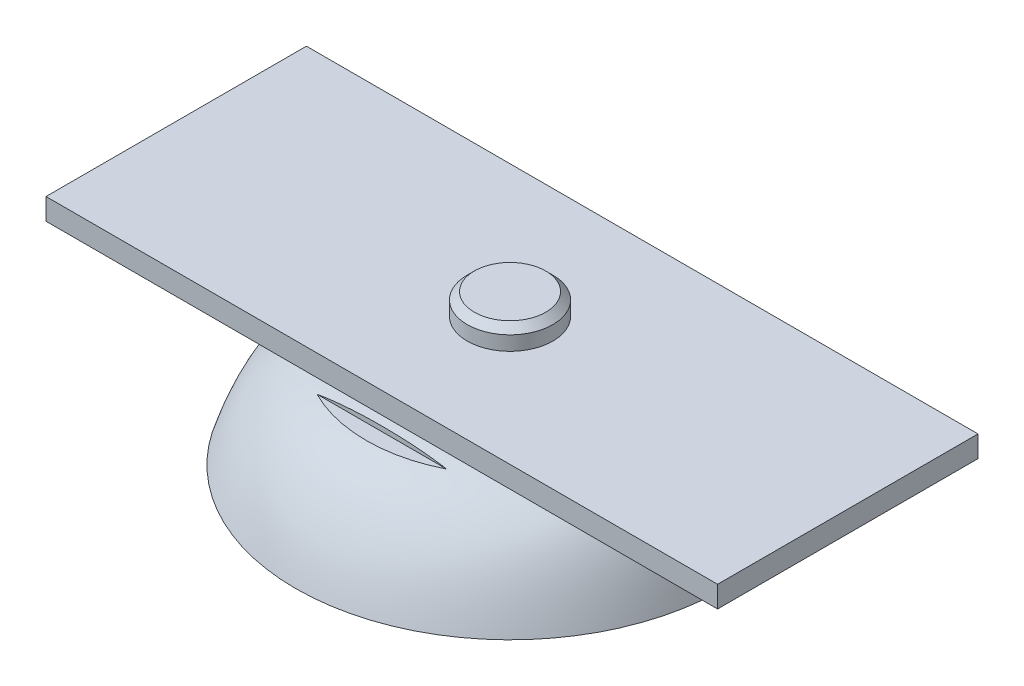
ISO-10303-21;
HEADER;
FILE_DESCRIPTION(('STEP AP214'),'2;1');
FILE_NAME('part.step','',(''),(''),'','','');
FILE_SCHEMA(('AUTOMOTIVE_DESIGN { 1 0 10303 214 1 1 1 1 }'));
ENDSEC;
DATA;
#1=APPLICATION_CONTEXT('core data for automotive mechanical design processes');
#2=APPLICATION_PROTOCOL_DEFINITION('international standard','automotive_design',2000,#1);
#3=PRODUCT_CONTEXT('',#1,'mechanical');
#4=PRODUCT('Part','Part','',(#3));
#5=PRODUCT_RELATED_PRODUCT_CATEGORY('part','',(#4));
#6=PRODUCT_DEFINITION_FORMATION('','',#4);
#7=PRODUCT_DEFINITION_CONTEXT('part definition',#1,'design');
#8=PRODUCT_DEFINITION('design','',#6,#7);
#9=PRODUCT_DEFINITION_SHAPE('','',#8);
#10=(LENGTH_UNIT() NAMED_UNIT(*) SI_UNIT(.MILLI.,.METRE.));
#11=(NAMED_UNIT(*) PLANE_ANGLE_UNIT() SI_UNIT($,.RADIAN.));
#12=(NAMED_UNIT(*) SI_UNIT($,.STERADIAN.) SOLID_ANGLE_UNIT());
#13=UNCERTAINTY_MEASURE_WITH_UNIT(LENGTH_MEASURE(1.E-05),#10,'distance_accuracy_value','');
#14=(GEOMETRIC_REPRESENTATION_CONTEXT(3) GLOBAL_UNCERTAINTY_ASSIGNED_CONTEXT((#13)) GLOBAL_UNIT_ASSIGNED_CONTEXT((#10,
#11,#12)) REPRESENTATION_CONTEXT('',''));
#15=CARTESIAN_POINT('',(0.,0.,0.));
#16=DIRECTION('',(0.,0.,1.));
#17=DIRECTION('',(1.,0.,0.));
#18=AXIS2_PLACEMENT_3D('',#15,#16,#17);
#19=CARTESIAN_POINT('',(0.,0.,0.));
#20=CARTESIAN_POINT('',(-20.874020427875,0.,0.));
#21=CARTESIAN_POINT('',(-25.7093674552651,-1.5969318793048,0.));
#22=CARTESIAN_POINT('',(-30.,-15.,0.));
#23=B_SPLINE_CURVE_WITH_KNOTS('',3,(#19,#20,#21,#22),.UNSPECIFIED.,.F.,.F.,(4,4),(0.,1.),.UNSPECIFIED.);
#24=CARTESIAN_POINT('',(0.,0.,0.));
#25=DIRECTION('',(0.,1.,0.));
#26=AXIS1_PLACEMENT('',#24,#25);
#27=SURFACE_OF_REVOLUTION('',#23,#26);
#28=CARTESIAN_POINT('',(0.,-2.,0.));
#29=DIRECTION('',(0.,1.,0.));
#30=DIRECTION('',(0.,0.,1.));
#31=AXIS2_PLACEMENT_3D('',#28,#29,#30);
#32=CIRCLE('',#31,20.1135798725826);
#33=CARTESIAN_POINT('',(-9.07603953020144,-2.,17.9494178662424));
#34=VERTEX_POINT('',#33);
#35=CARTESIAN_POINT('',(9.07603953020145,-2.,17.9494178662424));
#36=VERTEX_POINT('',#35);
#37=EDGE_CURVE('E13',#34,#36,#32,.T.);
#38=ORIENTED_EDGE('',*,*,#37,.F.);
#39=CARTESIAN_POINT('',(-9.07603953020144,-2.,17.9494178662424));
#40=CARTESIAN_POINT('',(-8.89157111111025,-1.96797138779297,17.9494178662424));
#41=CARTESIAN_POINT('',(-8.70684774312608,-1.93743019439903,17.9494178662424));
#42=CARTESIAN_POINT('',(-8.33700445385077,-1.87914600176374,17.9494178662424));
#43=CARTESIAN_POINT('',(-8.15188463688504,-1.85140234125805,17.9494178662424));
#44=CARTESIAN_POINT('',(-7.78129128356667,-1.79852398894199,17.9494178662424));
#45=CARTESIAN_POINT('',(-7.59581778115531,-1.77338905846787,17.9494178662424));
#46=CARTESIAN_POINT('',(-7.22498171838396,-1.72561775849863,17.9494178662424));
#47=CARTESIAN_POINT('',(-7.03961987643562,-1.70297579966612,17.9494178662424));
#48=CARTESIAN_POINT('',(-6.66861790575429,-1.65997514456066,17.9494178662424));
#49=CARTESIAN_POINT('',(-6.48297775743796,-1.63961661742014,17.9494178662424));
#50=CARTESIAN_POINT('',(-6.11145636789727,-1.60105378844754,17.9494178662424));
#51=CARTESIAN_POINT('',(-5.92557510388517,-1.58284970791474,17.9494178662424));
#52=CARTESIAN_POINT('',(-5.12656391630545,-1.50899608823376,17.9494178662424));
#53=CARTESIAN_POINT('',(-4.51248817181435,-1.46334995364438,17.9494178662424));
#54=CARTESIAN_POINT('',(-3.28307694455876,-1.39083501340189,17.9494178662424));
#55=CARTESIAN_POINT('',(-2.66774111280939,-1.36397241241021,17.9494178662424));
#56=CARTESIAN_POINT('',(-1.43642265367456,-1.3271751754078,17.9494178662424));
#57=CARTESIAN_POINT('',(-0.820439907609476,-1.31724455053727,17.9494178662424));
#58=CARTESIAN_POINT('',(0.411549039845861,-1.31363032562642,17.9494178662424));
#59=CARTESIAN_POINT('',(1.02755523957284,-1.31994613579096,17.9494178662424));
#60=CARTESIAN_POINT('',(2.26583412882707,-1.34942306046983,17.9494178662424));
#61=CARTESIAN_POINT('',(2.88810255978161,-1.37276557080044,17.9494178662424));
#62=CARTESIAN_POINT('',(4.13149511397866,-1.43814315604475,17.9494178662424));
#63=CARTESIAN_POINT('',(4.75261954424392,-1.48017213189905,17.9494178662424));
#64=CARTESIAN_POINT('',(5.68279195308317,-1.55951981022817,17.9494178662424));
#65=CARTESIAN_POINT('',(5.99254505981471,-1.58868012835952,17.9494178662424));
#66=CARTESIAN_POINT('',(6.61142405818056,-1.65298049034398,17.9494178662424));
#67=CARTESIAN_POINT('',(6.92054997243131,-1.68812031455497,17.9494178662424));
#68=CARTESIAN_POINT('',(7.5380446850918,-1.76500782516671,17.9494178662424));
#69=CARTESIAN_POINT('',(7.84641333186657,-1.8067567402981,17.9494178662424));
#70=CARTESIAN_POINT('',(8.46209651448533,-1.89764256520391,17.9494178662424));
#71=CARTESIAN_POINT('',(8.769410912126,-1.94678040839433,17.9494178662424));
#72=CARTESIAN_POINT('',(9.07603953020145,-2.,17.9494178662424));
#73=B_SPLINE_CURVE_WITH_KNOTS('',3,(#39,#40,#41,#42,#43,#44,#45,#46,#47,#48,#49,#50,#51,#52,#53,
#54,#55,#56,#57,#58,#59,#60,#61,#62,#63,#64,#65,#66,#67,#68,#69,#70,#71,#72),.UNSPECIFIED.,.F.,
.F.,(4,2,2,2,2,2,2,2,2,2,2,2,2,2,2,2,4),(0.,0.561674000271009,1.12321492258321,1.68470442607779,
2.24490824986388,2.80515354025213,3.36545632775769,5.21237523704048,7.0599039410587,
8.90787025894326,10.755769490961,12.62364850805,14.4909183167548,15.4242392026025,
16.3575258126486,17.2909861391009,18.2245644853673),.UNSPECIFIED.);
#74=EDGE_CURVE('E76',#34,#36,#73,.T.);
#75=ORIENTED_EDGE('',*,*,#74,.T.);
#76=EDGE_LOOP('',(#38,#75));
#77=FACE_BOUND('',#76,.T.);
#78=CARTESIAN_POINT('',(7.89342101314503,-2.,-18.5));
#79=VERTEX_POINT('',#78);
#80=CARTESIAN_POINT('',(-7.8934210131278,-1.99999999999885,-18.5000000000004));
#81=VERTEX_POINT('',#80);
#82=EDGE_CURVE('E86',#79,#81,#32,.T.);
#83=ORIENTED_EDGE('',*,*,#82,.F.);
#84=CARTESIAN_POINT('',(-7.8934210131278,-1.99999999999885,-18.5000000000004));
#85=CARTESIAN_POINT('',(-7.70834983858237,-1.97205392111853,-18.5000000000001));
#86=CARTESIAN_POINT('',(-7.52307384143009,-1.94548139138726,-18.5));
#87=CARTESIAN_POINT('',(-7.15220375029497,-1.89493111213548,-18.5));
#88=CARTESIAN_POINT('',(-6.96660972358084,-1.87095286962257,-18.5));
#89=CARTESIAN_POINT('',(-6.59513838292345,-1.82543001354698,-18.5));
#90=CARTESIAN_POINT('',(-6.40926109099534,-1.80388521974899,-18.5));
#91=CARTESIAN_POINT('',(-6.03763845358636,-1.76313198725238,-18.5));
#92=CARTESIAN_POINT('',(-5.85189362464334,-1.74391882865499,-18.5));
#93=CARTESIAN_POINT('',(-5.48018169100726,-1.70765317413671,-18.5));
#94=CARTESIAN_POINT('',(-5.29421457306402,-1.6906008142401,-18.5));
#95=CARTESIAN_POINT('',(-4.92208759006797,-1.65854858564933,-18.5));
#96=CARTESIAN_POINT('',(-4.73592770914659,-1.64354890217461,-18.5));
#97=CARTESIAN_POINT('',(-4.20564762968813,-1.60362455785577,-18.5));
#98=CARTESIAN_POINT('',(-3.8613476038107,-1.58106023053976,-18.5));
#99=CARTESIAN_POINT('',(-3.17239174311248,-1.54211514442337,-18.5));
#100=CARTESIAN_POINT('',(-2.8277358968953,-1.52573459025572,-18.5));
#101=CARTESIAN_POINT('',(-2.13811932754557,-1.49880169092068,-18.5));
#102=CARTESIAN_POINT('',(-1.79315855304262,-1.4882506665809,-18.5));
#103=CARTESIAN_POINT('',(-1.10310647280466,-1.47275465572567,-18.5));
#104=CARTESIAN_POINT('',(-0.758015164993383,-1.4678097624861,-18.5));
#105=CARTESIAN_POINT('',(-0.0677904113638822,-1.46341992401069,-18.5));
#106=CARTESIAN_POINT('',(0.277343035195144,-1.46397509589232,-18.5));
#107=CARTESIAN_POINT('',(0.967556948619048,-1.47059762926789,-18.5));
#108=CARTESIAN_POINT('',(1.31263741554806,-1.47666498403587,-18.5));
#109=CARTESIAN_POINT('',(2.00540795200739,-1.49451327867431,-18.5));
#110=CARTESIAN_POINT('',(2.35309686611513,-1.50633943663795,-18.5));
#111=CARTESIAN_POINT('',(3.04821396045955,-1.53598389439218,-18.5));
#112=CARTESIAN_POINT('',(3.39564214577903,-1.55380207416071,-18.5));
#113=CARTESIAN_POINT('',(4.09003951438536,-1.59581729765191,-18.5));
#114=CARTESIAN_POINT('',(4.43700878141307,-1.62001294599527,-18.5));
#115=CARTESIAN_POINT('',(5.13038563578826,-1.67532088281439,-18.5));
#116=CARTESIAN_POINT('',(5.47679324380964,-1.7064329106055,-18.5));
#117=CARTESIAN_POINT('',(6.16886008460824,-1.77625382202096,-18.5));
#118=CARTESIAN_POINT('',(6.51451929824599,-1.81496289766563,-18.5));
#119=CARTESIAN_POINT('',(7.20482035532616,-1.90088130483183,-18.5));
#120=CARTESIAN_POINT('',(7.54946206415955,-1.94809171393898,-18.5));
#121=CARTESIAN_POINT('',(7.89342101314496,-1.99999999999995,-18.4999999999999));
#122=B_SPLINE_CURVE_WITH_KNOTS('',3,(#84,#85,#86,#87,#88,#89,#90,#91,#92,#93,#94,#95,#96,#97,
#98,#99,#100,#101,#102,#103,#104,#105,#106,#107,#108,#109,#110,#111,#112,#113,#114,#115,#116,
#117,#118,#119,#120,#121),.UNSPECIFIED.,.F.,.F.,(4,2,2,2,2,2,2,2,2,2,2,2,2,2,2,2,2,2,4),(0.,
0.56149881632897,1.12289074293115,1.684241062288,2.24443539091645,2.80466496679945,
3.36494506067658,4.39999512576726,5.43507943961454,6.47039818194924,7.50573414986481,
8.54109216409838,9.57644891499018,10.6200696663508,11.6636695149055,12.7070412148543,
13.7503735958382,14.7937323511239,15.8372234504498),.UNSPECIFIED.);
#123=EDGE_CURVE('E110',#81,#79,#122,.T.);
#124=ORIENTED_EDGE('',*,*,#123,.F.);
#125=EDGE_LOOP('',(#83,#124));
#126=FACE_BOUND('',#125,.T.);
#127=CARTESIAN_POINT('',(0.,-15.,0.));
#128=DIRECTION('',(0.,1.,0.));
#129=DIRECTION('',(0.,0.,1.));
#130=AXIS2_PLACEMENT_3D('',#127,#128,#129);
#131=CIRCLE('',#130,30.);
#132=CARTESIAN_POINT('',(0.,-15.,30.));
#133=VERTEX_POINT('',#132);
#134=EDGE_CURVE('E118',#133,#133,#131,.T.);
#135=ORIENTED_EDGE('',*,*,#134,.T.);
#136=EDGE_LOOP('',(#135));
#137=FACE_BOUND('',#136,.T.);
#138=CARTESIAN_POINT('',(0.,0.,0.));
#139=VERTEX_POINT('',#138);
#140=VERTEX_LOOP('',#139);
#141=FACE_BOUND('',#140,.T.);
#142=ADVANCED_FACE('F71',(#77,#126,#137,#141),#27,.F.);
#143=CARTESIAN_POINT('',(-29.0476099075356,-15.304882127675,0.));
#144=CARTESIAN_POINT('',(-28.9188138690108,-14.902549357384,0.));
#145=CARTESIAN_POINT('',(-28.6487757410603,-14.0850312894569,0.));
#146=CARTESIAN_POINT('',(-28.1153111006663,-12.5830678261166,0.));
#147=CARTESIAN_POINT('',(-27.4272059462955,-10.8652398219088,0.));
#148=CARTESIAN_POINT('',(-26.5576677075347,-9.07279018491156,0.));
#149=CARTESIAN_POINT('',(-25.3128320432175,-7.01031835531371,0.));
#150=CARTESIAN_POINT('',(-23.5574609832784,-5.00265737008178,0.));
#151=CARTESIAN_POINT('',(-20.9249922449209,-3.2874070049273,0.));
#152=CARTESIAN_POINT('',(-17.4744922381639,-2.10745095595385,0.));
#153=CARTESIAN_POINT('',(-13.7350138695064,-1.51047849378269,0.));
#154=CARTESIAN_POINT('',(-10.1430474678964,-1.22040904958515,0.));
#155=CARTESIAN_POINT('',(-7.13159747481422,-1.08317924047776,0.));
#156=CARTESIAN_POINT('',(-4.33187174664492,-1.02423994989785,0.));
#157=CARTESIAN_POINT('',(-1.92748378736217,-1.00311174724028,0.));
#158=CARTESIAN_POINT('',(-0.634970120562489,-1.,0.));
#159=CARTESIAN_POINT('',(0.,-1.,0.));
#160=B_SPLINE_CURVE_WITH_KNOTS('',3,(#143,#144,#145,#146,#147,#148,#149,#150,#151,#152,#153,
#154,#155,#156,#157,#158,#159),.UNSPECIFIED.,.F.,.F.,(4,1,1,1,1,1,1,1,1,1,1,1,1,1,4),(0.,
0.03125,0.0625,0.125,0.1875,0.25,0.375,0.5,0.625,0.75,0.8125,0.875,0.9375,0.96875,1.),.UNSPECIFIED.);
#161=CARTESIAN_POINT('',(0.,0.,0.));
#162=DIRECTION('',(0.,1.,0.));
#163=AXIS1_PLACEMENT('',#161,#162);
#164=SURFACE_OF_REVOLUTION('',#160,#163);
#165=CARTESIAN_POINT('',(0.,-1.,0.));
#166=VERTEX_POINT('',#165);
#167=VERTEX_LOOP('',#166);
#168=FACE_BOUND('',#167,.T.);
#169=CARTESIAN_POINT('',(0.,-15.304882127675,0.));
#170=DIRECTION('',(0.,1.,0.));
#171=DIRECTION('',(0.,0.,1.));
#172=AXIS2_PLACEMENT_3D('',#169,#170,#171);
#173=CIRCLE('',#172,29.0476099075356);
#174=CARTESIAN_POINT('',(0.,-15.304882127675,29.0476099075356));
#175=VERTEX_POINT('',#174);
#176=EDGE_CURVE('E114',#175,#175,#173,.T.);
#177=ORIENTED_EDGE('',*,*,#176,.F.);
#178=EDGE_LOOP('',(#177));
#179=FACE_BOUND('',#178,.T.);
#180=ADVANCED_FACE('F140',(#168,#179),#164,.F.);
#181=CARTESIAN_POINT('',(0.,-15.,0.));
#182=DIRECTION('',(0.,1.,0.));
#183=DIRECTION('',(0.,0.,1.));
#184=AXIS2_PLACEMENT_3D('',#181,#182,#183);
#185=CONICAL_SURFACE('',#184,30.,1.26098166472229);
#186=ORIENTED_EDGE('',*,*,#176,.T.);
#187=EDGE_LOOP('',(#186));
#188=FACE_BOUND('',#187,.T.);
#189=ORIENTED_EDGE('',*,*,#134,.F.);
#190=EDGE_LOOP('',(#189));
#191=FACE_BOUND('',#190,.T.);
#192=ADVANCED_FACE('F131',(#188,#191),#185,.T.);
#193=CARTESIAN_POINT('',(-47.,-2.,-18.5));
#194=DIRECTION('',(0.,0.,1.));
#195=DIRECTION('',(1.,0.,0.));
#196=AXIS2_PLACEMENT_3D('',#193,#194,#195);
#197=PLANE('',#196);
#198=ORIENTED_EDGE('',*,*,#123,.T.);
#199=DIRECTION('',(1.,0.,0.));
#200=VECTOR('',#199,1.);
#201=CARTESIAN_POINT('',(-47.,-2.,-18.5));
#202=LINE('',#201,#200);
#203=EDGE_CURVE('E98',#81,#79,#202,.T.);
#204=ORIENTED_EDGE('',*,*,#203,.F.);
#205=EDGE_LOOP('',(#198,#204));
#206=FACE_BOUND('',#205,.T.);
#207=ADVANCED_FACE('F111',(#206),#197,.F.);
#208=CARTESIAN_POINT('',(0.,-2.,0.));
#209=DIRECTION('',(0.,-1.,0.));
#210=DIRECTION('',(0.,0.,-1.));
#211=AXIS2_PLACEMENT_3D('',#208,#209,#210);
#212=PLANE('',#211);
#213=ORIENTED_EDGE('',*,*,#82,.T.);
#214=ORIENTED_EDGE('',*,*,#203,.T.);
#215=EDGE_LOOP('',(#213,#214));
#216=FACE_BOUND('',#215,.T.);
#217=ADVANCED_FACE('F117',(#216),#212,.F.);
#218=ORIENTED_EDGE('',*,*,#37,.T.);
#219=DIRECTION('',(1.,0.,0.));
#220=VECTOR('',#219,1.);
#221=CARTESIAN_POINT('',(-47.,-2.,17.9494178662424));
#222=LINE('',#221,#220);
#223=EDGE_CURVE('E92',#34,#36,#222,.T.);
#224=ORIENTED_EDGE('',*,*,#223,.F.);
#225=EDGE_LOOP('',(#218,#224));
#226=FACE_BOUND('',#225,.T.);
#227=ADVANCED_FACE('F136',(#226),#212,.F.);
#228=CARTESIAN_POINT('',(-47.,-2.,17.9494178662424));
#229=DIRECTION('',(0.,0.,1.));
#230=DIRECTION('',(1.,0.,0.));
#231=AXIS2_PLACEMENT_3D('',#228,#229,#230);
#232=PLANE('',#231);
#233=ORIENTED_EDGE('',*,*,#223,.T.);
#234=ORIENTED_EDGE('',*,*,#74,.F.);
#235=EDGE_LOOP('',(#233,#234));
#236=FACE_BOUND('',#235,.T.);
#237=ADVANCED_FACE('F132',(#236),#232,.T.);
#238=CLOSED_SHELL('',(#142,#180,#192,#207,#217,#227,#237));
#239=MANIFOLD_SOLID_BREP('B2',#238);
#240=CARTESIAN_POINT('',(47.,3.,27.5));
#241=DIRECTION('',(-1.,0.,0.));
#242=DIRECTION('',(0.,0.,1.));
#243=AXIS2_PLACEMENT_3D('',#240,#241,#242);
#244=PLANE('',#243);
#245=DIRECTION('',(0.,1.,0.));
#246=VECTOR('',#245,1.);
#247=CARTESIAN_POINT('',(47.,-2.,17.9494178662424));
#248=LINE('',#247,#246);
#249=CARTESIAN_POINT('',(47.,0.,17.9494178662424));
#250=VERTEX_POINT('',#249);
#251=CARTESIAN_POINT('',(47.,3.,17.9494178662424));
#252=VERTEX_POINT('',#251);
#253=EDGE_CURVE('E273',#250,#252,#248,.T.);
#254=ORIENTED_EDGE('',*,*,#253,.F.);
#255=DIRECTION('',(0.,0.,-1.));
#256=VECTOR('',#255,1.);
#257=CARTESIAN_POINT('',(47.,0.,27.5));
#258=LINE('',#257,#256);
#259=CARTESIAN_POINT('',(47.,0.,-18.5));
#260=VERTEX_POINT('',#259);
#261=EDGE_CURVE('E272',#250,#260,#258,.T.);
#262=ORIENTED_EDGE('',*,*,#261,.T.);
#263=DIRECTION('',(0.,1.,0.));
#264=VECTOR('',#263,1.);
#265=CARTESIAN_POINT('',(47.,-2.,-18.5));
#266=LINE('',#265,#264);
#267=CARTESIAN_POINT('',(47.,3.,-18.5));
#268=VERTEX_POINT('',#267);
#269=EDGE_CURVE('E257',#260,#268,#266,.T.);
#270=ORIENTED_EDGE('',*,*,#269,.T.);
#271=DIRECTION('',(0.,0.,-1.));
#272=VECTOR('',#271,1.);
#273=CARTESIAN_POINT('',(47.,3.,27.5));
#274=LINE('',#273,#272);
#275=EDGE_CURVE('E270',#252,#268,#274,.T.);
#276=ORIENTED_EDGE('',*,*,#275,.F.);
#277=EDGE_LOOP('',(#254,#262,#270,#276));
#278=FACE_BOUND('',#277,.T.);
#279=ADVANCED_FACE('F216',(#278),#244,.F.);
#280=CARTESIAN_POINT('',(-47.,3.,27.5));
#281=DIRECTION('',(1.,0.,0.));
#282=DIRECTION('',(0.,0.,-1.));
#283=AXIS2_PLACEMENT_3D('',#280,#281,#282);
#284=PLANE('',#283);
#285=DIRECTION('',(0.,1.,0.));
#286=VECTOR('',#285,1.);
#287=CARTESIAN_POINT('',(-47.,-2.,17.9494178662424));
#288=LINE('',#287,#286);
#289=CARTESIAN_POINT('',(-47.,0.,17.9494178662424));
#290=VERTEX_POINT('',#289);
#291=CARTESIAN_POINT('',(-47.,3.,17.9494178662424));
#292=VERTEX_POINT('',#291);
#293=EDGE_CURVE('E231',#290,#292,#288,.T.);
#294=ORIENTED_EDGE('',*,*,#293,.T.);
#295=DIRECTION('',(0.,0.,1.));
#296=VECTOR('',#295,1.);
#297=CARTESIAN_POINT('',(-47.,3.,27.5));
#298=LINE('',#297,#296);
#299=CARTESIAN_POINT('',(-47.,3.,-18.5));
#300=VERTEX_POINT('',#299);
#301=EDGE_CURVE('E278',#300,#292,#298,.T.);
#302=ORIENTED_EDGE('',*,*,#301,.F.);
#303=DIRECTION('',(0.,1.,0.));
#304=VECTOR('',#303,1.);
#305=CARTESIAN_POINT('',(-47.,-2.,-18.5));
#306=LINE('',#305,#304);
#307=CARTESIAN_POINT('',(-47.,0.,-18.5));
#308=VERTEX_POINT('',#307);
#309=EDGE_CURVE('E260',#308,#300,#306,.T.);
#310=ORIENTED_EDGE('',*,*,#309,.F.);
#311=DIRECTION('',(0.,0.,1.));
#312=VECTOR('',#311,1.);
#313=CARTESIAN_POINT('',(-47.,0.,27.5));
#314=LINE('',#313,#312);
#315=EDGE_CURVE('E279',#308,#290,#314,.T.);
#316=ORIENTED_EDGE('',*,*,#315,.T.);
#317=EDGE_LOOP('',(#294,#302,#310,#316));
#318=FACE_BOUND('',#317,.T.);
#319=ADVANCED_FACE('F309',(#318),#284,.F.);
#320=CARTESIAN_POINT('',(42.,3.,27.5));
#321=DIRECTION('',(0.,1.,0.));
#322=DIRECTION('',(0.,0.,1.));
#323=AXIS2_PLACEMENT_3D('',#320,#321,#322);
#324=PLANE('',#323);
#325=CARTESIAN_POINT('',(0.,3.,0.));
#326=DIRECTION('',(0.,1.,0.));
#327=DIRECTION('',(0.,0.,1.));
#328=AXIS2_PLACEMENT_3D('',#325,#326,#327);
#329=CIRCLE('',#328,6.);
#330=CARTESIAN_POINT('',(0.,3.,6.));
#331=VERTEX_POINT('',#330);
#332=EDGE_CURVE('E266',#331,#331,#329,.T.);
#333=ORIENTED_EDGE('',*,*,#332,.F.);
#334=EDGE_LOOP('',(#333));
#335=FACE_BOUND('',#334,.T.);
#336=ORIENTED_EDGE('',*,*,#301,.T.);
#337=DIRECTION('',(1.,0.,0.));
#338=VECTOR('',#337,1.);
#339=CARTESIAN_POINT('',(-47.,3.,17.9494178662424));
#340=LINE('',#339,#338);
#341=EDGE_CURVE('E277',#292,#252,#340,.T.);
#342=ORIENTED_EDGE('',*,*,#341,.T.);
#343=ORIENTED_EDGE('',*,*,#275,.T.);
#344=DIRECTION('',(1.,0.,0.));
#345=VECTOR('',#344,1.);
#346=CARTESIAN_POINT('',(39.,3.,-18.5));
#347=LINE('',#346,#345);
#348=EDGE_CURVE('E254',#300,#268,#347,.T.);
#349=ORIENTED_EDGE('',*,*,#348,.F.);
#350=EDGE_LOOP('',(#336,#342,#343,#349));
#351=FACE_BOUND('',#350,.T.);
#352=ADVANCED_FACE('F276',(#335,#351),#324,.T.);
#353=CARTESIAN_POINT('',(42.,0.,27.5));
#354=DIRECTION('',(0.,1.,0.));
#355=DIRECTION('',(0.,0.,1.));
#356=AXIS2_PLACEMENT_3D('',#353,#354,#355);
#357=PLANE('',#356);
#358=DIRECTION('',(1.,0.,0.));
#359=VECTOR('',#358,1.);
#360=CARTESIAN_POINT('',(42.,0.,17.9494178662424));
#361=LINE('',#360,#359);
#362=EDGE_CURVE('E69',#290,#250,#361,.T.);
#363=ORIENTED_EDGE('',*,*,#362,.F.);
#364=ORIENTED_EDGE('',*,*,#315,.F.);
#365=DIRECTION('',(1.,0.,0.));
#366=VECTOR('',#365,1.);
#367=CARTESIAN_POINT('',(39.,0.,-18.5));
#368=LINE('',#367,#366);
#369=EDGE_CURVE('E265',#308,#260,#368,.T.);
#370=ORIENTED_EDGE('',*,*,#369,.T.);
#371=ORIENTED_EDGE('',*,*,#261,.F.);
#372=EDGE_LOOP('',(#363,#364,#370,#371));
#373=FACE_BOUND('',#372,.T.);
#374=ADVANCED_FACE('F317',(#373),#357,.F.);
#375=CARTESIAN_POINT('',(39.,0.,-18.5));
#376=DIRECTION('',(0.,0.,1.));
#377=DIRECTION('',(1.,0.,0.));
#378=AXIS2_PLACEMENT_3D('',#375,#376,#377);
#379=PLANE('',#378);
#380=ORIENTED_EDGE('',*,*,#348,.T.);
#381=ORIENTED_EDGE('',*,*,#269,.F.);
#382=ORIENTED_EDGE('',*,*,#369,.F.);
#383=ORIENTED_EDGE('',*,*,#309,.T.);
#384=EDGE_LOOP('',(#380,#381,#382,#383));
#385=FACE_BOUND('',#384,.T.);
#386=ADVANCED_FACE('F256',(#385),#379,.F.);
#387=CARTESIAN_POINT('',(0.,6.,0.));
#388=DIRECTION('',(0.,-1.,0.));
#389=DIRECTION('',(0.,0.,-1.));
#390=AXIS2_PLACEMENT_3D('',#387,#388,#389);
#391=CYLINDRICAL_SURFACE('',#390,6.);
#392=CARTESIAN_POINT('',(0.,4.99999999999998,0.));
#393=DIRECTION('',(0.,1.,0.));
#394=DIRECTION('',(0.,0.,1.));
#395=AXIS2_PLACEMENT_3D('',#392,#393,#394);
#396=CIRCLE('',#395,6.);
#397=CARTESIAN_POINT('',(0.,4.99999999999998,6.));
#398=VERTEX_POINT('',#397);
#399=EDGE_CURVE('E225',#398,#398,#396,.F.);
#400=ORIENTED_EDGE('',*,*,#399,.T.);
#401=EDGE_LOOP('',(#400));
#402=FACE_BOUND('',#401,.T.);
#403=ORIENTED_EDGE('',*,*,#332,.T.);
#404=EDGE_LOOP('',(#403));
#405=FACE_BOUND('',#404,.T.);
#406=ADVANCED_FACE('F292',(#402,#405),#391,.T.);
#407=CARTESIAN_POINT('',(0.,6.,0.));
#408=DIRECTION('',(0.,1.,0.));
#409=DIRECTION('',(0.,0.,1.));
#410=AXIS2_PLACEMENT_3D('',#407,#408,#409);
#411=PLANE('',#410);
#412=CARTESIAN_POINT('',(0.,6.,0.));
#413=DIRECTION('',(0.,1.,0.));
#414=DIRECTION('',(0.,0.,1.));
#415=AXIS2_PLACEMENT_3D('',#412,#413,#414);
#416=CIRCLE('',#415,4.99999999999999);
#417=CARTESIAN_POINT('',(0.,6.,4.99999999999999));
#418=VERTEX_POINT('',#417);
#419=EDGE_CURVE('E281',#418,#418,#416,.T.);
#420=ORIENTED_EDGE('',*,*,#419,.T.);
#421=EDGE_LOOP('',(#420));
#422=FACE_BOUND('',#421,.T.);
#423=ADVANCED_FACE('F298',(#422),#411,.T.);
#424=CARTESIAN_POINT('',(0.,6.,0.));
#425=DIRECTION('',(0.,-1.,0.));
#426=DIRECTION('',(0.,0.,-1.));
#427=AXIS2_PLACEMENT_3D('',#424,#425,#426);
#428=CONICAL_SURFACE('',#427,4.99999999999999,0.785398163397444);
#429=ORIENTED_EDGE('',*,*,#399,.F.);
#430=EDGE_LOOP('',(#429));
#431=FACE_BOUND('',#430,.T.);
#432=ORIENTED_EDGE('',*,*,#419,.F.);
#433=EDGE_LOOP('',(#432));
#434=FACE_BOUND('',#433,.T.);
#435=ADVANCED_FACE('F219',(#431,#434),#428,.T.);
#436=CARTESIAN_POINT('',(-47.,-2.,17.9494178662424));
#437=DIRECTION('',(0.,0.,1.));
#438=DIRECTION('',(1.,0.,0.));
#439=AXIS2_PLACEMENT_3D('',#436,#437,#438);
#440=PLANE('',#439);
#441=ORIENTED_EDGE('',*,*,#362,.T.);
#442=ORIENTED_EDGE('',*,*,#253,.T.);
#443=ORIENTED_EDGE('',*,*,#341,.F.);
#444=ORIENTED_EDGE('',*,*,#293,.F.);
#445=EDGE_LOOP('',(#441,#442,#443,#444));
#446=FACE_BOUND('',#445,.T.);
#447=ADVANCED_FACE('F297',(#446),#440,.T.);
#448=CLOSED_SHELL('',(#279,#319,#352,#374,#386,#406,#423,#435,#447));
#449=MANIFOLD_SOLID_BREP('B7',#448);
#450=ADVANCED_BREP_SHAPE_REPRESENTATION('',(#18,#239,#449),#14);
#451=SHAPE_DEFINITION_REPRESENTATION(#9,#450);
ENDSEC;
END-ISO-10303-21;
